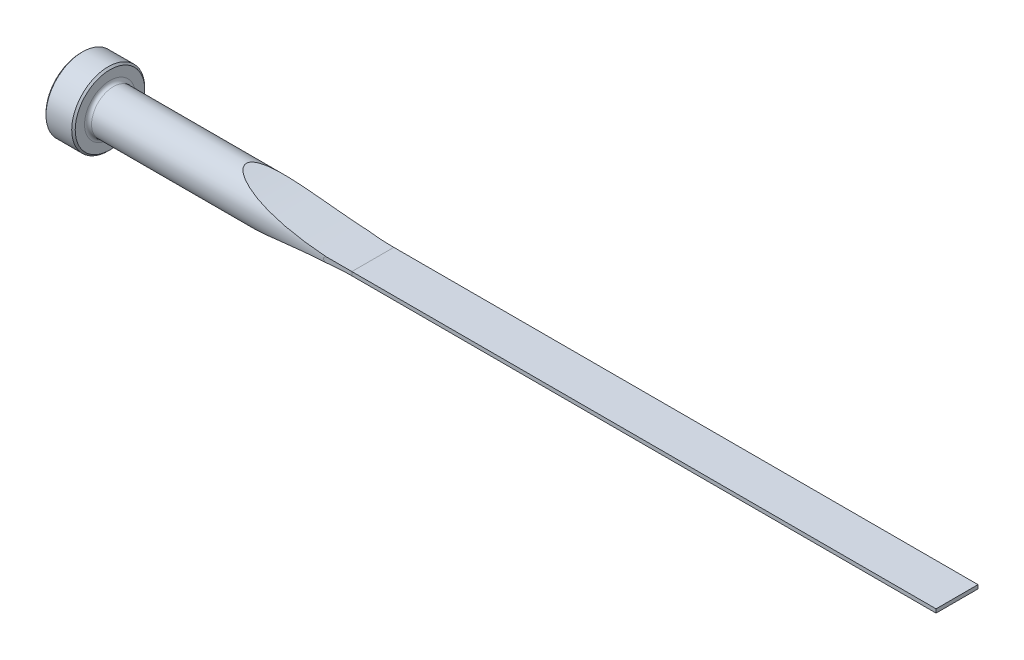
from build123d import *

# Parameters (mm, degrees)
CUT_EXTRUDE1_DEPTH = 191.830442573
CUT_EXTRUDE2_DEPTH = 191.830442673
FILLET1_R          = 0.762
CHAMFER1_SIZE      = 0.381


with BuildPart() as part:
    # Sketch1 → Revolve1 (revolve)
    with BuildSketch(Plane.XY, mode=Mode.PRIVATE) as revolve1_sk:
        Polygon((0, 0), (0, 7.9375), (6.35, 7.9375), (6.35, 4.7625), (190.5, 4.7625), (190.5, 0), align=None)
    revolve(revolve1_sk.sketch.rotate(Axis((0, 0, 0), (1, 0, 0)), 90), axis=Axis((0, 0, 0), (1, 0, 0)))

    # Sketch2 → Cut-Extrude1 (cut, symmetric)
    with BuildSketch(Plane.XY):
        with BuildLine():
            Line((190.5, 4.7625), (190.5, 0.4064))
            Line((190.5, 0.4064), (63.5, 0.4064))
            ThreePointArc((63.5, 0.4064), (49.584948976, 1.502178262), (36.012930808, 4.7625))
            Line((36.012930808, 4.7625), (190.5, 4.7625))
        make_face()
    cut_extrude1 = extrude(amount=CUT_EXTRUDE1_DEPTH, both=True, mode=Mode.SUBTRACT)

    # Mirror1: Cut-Extrude1 across plane
    add(cut_extrude1.mirror(Plane.ZX), mode=Mode.SUBTRACT)

    # Sketch3 → Cut-Extrude2 (cut, symmetric)
    with BuildSketch(Plane(origin=(0, 0, 0), x_dir=(1, 0, 0), z_dir=(0, 1, 0))):
        with BuildLine():
            Line((190.5, 4.7625), (190.5, 4.5593))
            Line((190.5, 4.5593), (63.5, 4.5593))
            ThreePointArc((63.5, 4.5593), (60.49463147, 4.610114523), (57.492698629, 4.7625))
            Line((57.492698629, 4.7625), (190.5, 4.7625))
        make_face()
    cut_extrude2 = extrude(amount=CUT_EXTRUDE2_DEPTH, both=True, mode=Mode.SUBTRACT)

    # Mirror2: Cut-Extrude2 across plane
    add(cut_extrude2.mirror(Plane.XY), mode=Mode.SUBTRACT)

    # Fillet1
    fillet1_edges = [part.edges().sort_by_distance(p)[0] for p in [
        (6.35, 0, -4.7625),
    ]]
    fillet(fillet1_edges, radius=FILLET1_R)

    # Chamfer1
    chamfer1_edges = [part.edges().sort_by_distance(p)[0] for p in [
        (6.35, 0, -7.9375),
        (0, 0, -7.9375),
    ]]
    chamfer(chamfer1_edges, length=CHAMFER1_SIZE)


solid = part.part
